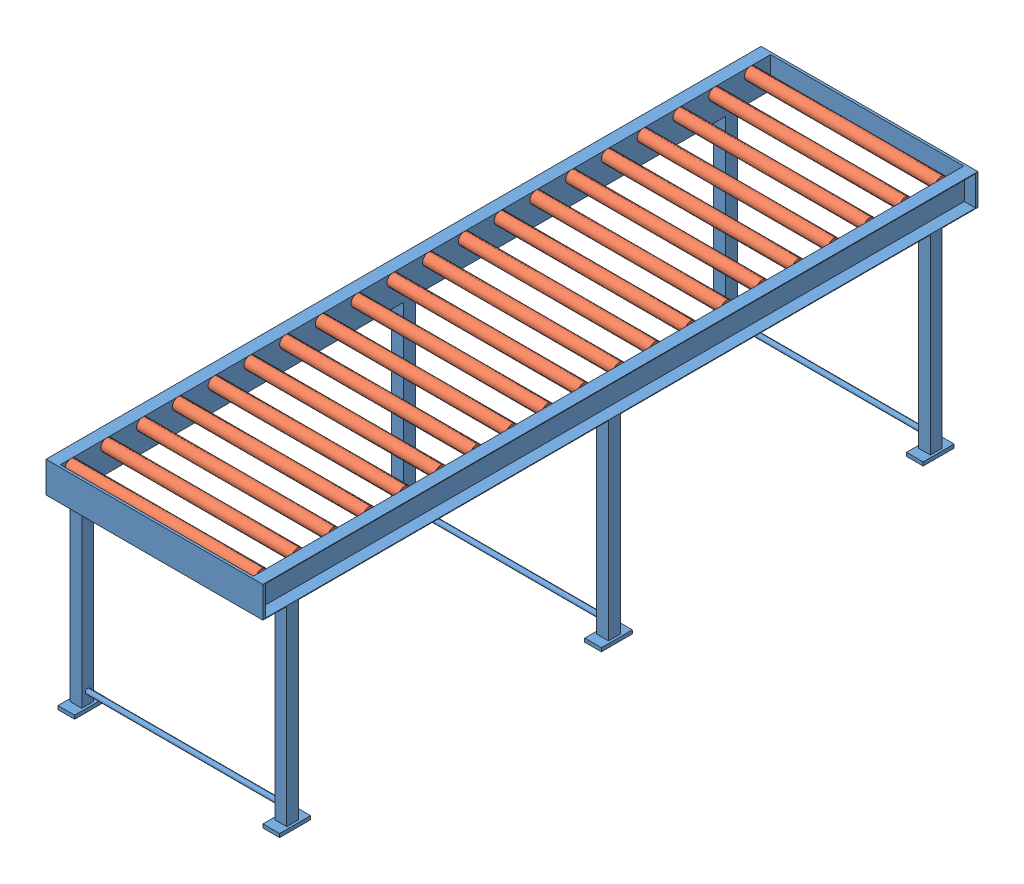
SolidWorks assembly Rollenbahn ZSB.SLDASM, configuration Standard (file format 4700). Lengths in mm.
Overall size (930 960.35 3000).
21 component instances, 2 part files, 40 mates.
Components (placement in the parent):
- Rahmenprofil 65x25-1: Rahmenprofil 65x25.SLDPRT [Standard] at (-273.4733 200.1645 990) size (930 945 3000)
- Transportrolle 50-1: Transportrolle 50.SLDPRT [Standard] at (-693.4733 310.1645 950) x (0 -0.866997 0.498313) z (1 0 0) size (50 50 840)
- Transportrolle 50-2: Transportrolle 50.SLDPRT [Standard] at (-693.4733 310.1645 800) x (0 0.350304 0.936636) z (1 0 0) size (50 50 840)
- Transportrolle 50-3: Transportrolle 50.SLDPRT [Standard] at (-693.4733 310.1645 650) x (0 0.989583 -0.143961) z (1 0 0) size (50 50 840)
- Transportrolle 50-4: Transportrolle 50.SLDPRT [Standard] at (146.5267 310.1645 500) x (0 -0.501387 0.865223) z (-1 0 0) size (50 50 840)
- Transportrolle 50-5: Transportrolle 50.SLDPRT [Standard] at (146.5267 310.1645 350) x (0 -0.723397 0.690432) z (-1 0 0) size (50 50 840)
- Transportrolle 50-6: Transportrolle 50.SLDPRT [Standard] at (146.5267 310.1645 200) x (0 -0.723378 0.690452) z (-1 0 0) size (50 50 840)
- Transportrolle 50-7: Transportrolle 50.SLDPRT [Standard] at (146.5267 310.1645 50) x (0 -0.511224 0.859448) z (-1 0 0) size (50 50 840)
- Transportrolle 50-8: Transportrolle 50.SLDPRT [Standard] at (146.5267 310.1645 -100) x (0 -0.832119 0.554596) z (-1 0 0) size (50 50 840)
- Transportrolle 50-9: Transportrolle 50.SLDPRT [Standard] at (146.5267 310.1645 -250) x (0 -0.997388 0.072231) z (-1 0 0) size (50 50 840)
- Transportrolle 50-10: Transportrolle 50.SLDPRT [Standard] at (146.5267 310.1645 -400) x (0 -0.756698 0.653765) z (-1 0 0) size (50 50 840)
- Transportrolle 50-11: Transportrolle 50.SLDPRT [Standard] at (146.5267 310.1645 -550) x (0 0.143342 0.989673) z (-1 0 0) size (50 50 840)
- Transportrolle 50-12: Transportrolle 50.SLDPRT [Standard] at (146.5267 310.1645 -700) x (0 -0.990083 0.140481) z (-1 0 0) size (50 50 840)
- Transportrolle 50-13: Transportrolle 50.SLDPRT [Standard] at (146.5267 310.1645 -850) x (0 0.999754 -0.022195) z (-1 0 0) size (50 50 840)
- Transportrolle 50-14: Transportrolle 50.SLDPRT [Standard] at (146.5267 310.1645 -1000) x (0 -0.624681 0.78088) z (-1 0 0) size (50 50 840)
- Transportrolle 50-15: Transportrolle 50.SLDPRT [Standard] at (146.5267 310.1645 -1150) x (0 -0.762737 0.646709) z (-1 0 0) size (50 50 840)
- Transportrolle 50-16: Transportrolle 50.SLDPRT [Standard] at (146.5267 310.1645 -1300) x (0 -0.739948 0.672664) z (-1 0 0) size (50 50 840)
- Transportrolle 50-17: Transportrolle 50.SLDPRT [Standard] at (146.5267 310.1645 -1450) x (0 -0.797332 0.603541) z (-1 0 0) size (50 50 840)
- Transportrolle 50-18: Transportrolle 50.SLDPRT [Standard] at (146.5267 310.1645 -1600) x (0 -0.783232 0.621729) z (-1 0 0) size (50 50 840)
- Transportrolle 50-19: Transportrolle 50.SLDPRT [Standard] at (146.5267 310.1645 -1750) x (0 -0.755157 0.655544) z (-1 0 0) size (50 50 840)
- Transportrolle 50-20: Transportrolle 50.SLDPRT [Standard] at (146.5267 310.1645 -1900) x (0 -0.874177 0.485608) z (-1 0 0) size (50 50 840)
Mates (geometry in assembly coordinates):
- Deckungsgleich1: coincident anti-aligned: axis of Rahmenprofil 65x25-1 through (131.5267 310.1645 950) axis (1 0 0); axis of Transportrolle 50-1 through (126.5267 310.1645 950) axis (-1 0 0)
- Deckungsgleich2: coincident anti-aligned: plane of Rahmenprofil 65x25-1 through (131.5267 200.1645 -1990) normal (-1 0 0); plane of Transportrolle 50-1 through (131.5267 310.1645 950) normal (1 0 0)
- Deckungsgleich3: coincident anti-aligned: axis of Rahmenprofil 65x25-1 through (-680.9733 310.1645 800) axis (1 0 0); axis of Transportrolle 50-2 through (126.5267 310.1645 800) axis (-1 0 0)
- Deckungsgleich4: coincident anti-aligned: axis of Rahmenprofil 65x25-1 through (-680.9733 310.1645 650) axis (1 0 0); axis of Transportrolle 50-3 through (126.5267 310.1645 650) axis (-1 0 0)
- Deckungsgleich5: coincident aligned: plane of Transportrolle 50-2 through (131.5267 310.1645 800) normal (1 0 0); plane of Transportrolle 50-3 through (131.5267 310.1645 650) normal (1 0 0)
- Deckungsgleich6: coincident anti-aligned: plane of Rahmenprofil 65x25-1 through (131.5267 200.1645 -1990) normal (-1 0 0); plane of Transportrolle 50-2 through (131.5267 310.1645 800) normal (1 0 0)
- Deckungsgleich25: coincident aligned: plane of Transportrolle 50-3 through (146.5267 310.1645 650) normal (1 0 0); plane of Transportrolle 50-4 through (146.5267 310.1645 500) normal (1 0 0)
- Deckungsgleich26: coincident aligned: plane of Transportrolle 50-3 through (146.5267 310.1645 650) normal (1 0 0); plane of Transportrolle 50-5 through (146.5267 310.1645 350) normal (1 0 0)
- Deckungsgleich27: coincident aligned: plane of Transportrolle 50-3 through (146.5267 310.1645 650) normal (1 0 0); plane of Transportrolle 50-6 through (146.5267 310.1645 200) normal (1 0 0)
- Deckungsgleich28: coincident aligned: plane of Transportrolle 50-3 through (146.5267 310.1645 650) normal (1 0 0); plane of Transportrolle 50-7 through (146.5267 310.1645 50) normal (1 0 0)
- Deckungsgleich29: coincident aligned: plane of Transportrolle 50-3 through (146.5267 310.1645 650) normal (1 0 0); plane of Transportrolle 50-8 through (146.5267 310.1645 -100) normal (1 0 0)
- Deckungsgleich30: coincident aligned: plane of Transportrolle 50-3 through (146.5267 310.1645 650) normal (1 0 0); plane of Transportrolle 50-9 through (146.5267 310.1645 -250) normal (1 0 0)
- Deckungsgleich31: coincident aligned: plane of Transportrolle 50-3 through (146.5267 310.1645 650) normal (1 0 0); plane of Transportrolle 50-10 through (146.5267 310.1645 -400) normal (1 0 0)
- Deckungsgleich32: coincident aligned: plane of Transportrolle 50-3 through (146.5267 310.1645 650) normal (1 0 0); plane of Transportrolle 50-11 through (146.5267 310.1645 -550) normal (1 0 0)
- Deckungsgleich33: coincident aligned: plane of Transportrolle 50-3 through (146.5267 310.1645 650) normal (1 0 0); plane of Transportrolle 50-12 through (146.5267 310.1645 -700) normal (1 0 0)
- Deckungsgleich34: coincident aligned: plane of Transportrolle 50-3 through (146.5267 310.1645 650) normal (1 0 0); plane of Transportrolle 50-13 through (146.5267 310.1645 -850) normal (1 0 0)
- Deckungsgleich35: coincident aligned: plane of Transportrolle 50-3 through (146.5267 310.1645 650) normal (1 0 0); plane of Transportrolle 50-14 through (146.5267 310.1645 -1000) normal (1 0 0)
- Deckungsgleich36: coincident aligned: plane of Transportrolle 50-3 through (146.5267 310.1645 650) normal (1 0 0); plane of Transportrolle 50-15 through (146.5267 310.1645 -1150) normal (1 0 0)
- Deckungsgleich37: coincident aligned: plane of Transportrolle 50-3 through (146.5267 310.1645 650) normal (1 0 0); plane of Transportrolle 50-16 through (146.5267 310.1645 -1300) normal (1 0 0)
- Deckungsgleich38: coincident aligned: plane of Transportrolle 50-3 through (146.5267 310.1645 650) normal (1 0 0); plane of Transportrolle 50-17 through (146.5267 310.1645 -1450) normal (1 0 0)
- Deckungsgleich39: coincident aligned: plane of Transportrolle 50-3 through (146.5267 310.1645 650) normal (1 0 0); plane of Transportrolle 50-18 through (146.5267 310.1645 -1600) normal (1 0 0)
- Deckungsgleich40: coincident aligned: plane of Transportrolle 50-3 through (146.5267 310.1645 650) normal (1 0 0); plane of Transportrolle 50-19 through (146.5267 310.1645 -1750) normal (1 0 0)
- Deckungsgleich41: coincident aligned: plane of Transportrolle 50-3 through (146.5267 310.1645 650) normal (1 0 0); plane of Transportrolle 50-20 through (146.5267 310.1645 -1900) normal (1 0 0)
- Konzentrisch1: concentric aligned: cylinder of Rahmenprofil 65x25-1 through (-738.4733 310.1645 500) axis (1 0 0) radius 6; cylinder of Transportrolle 50-4 through (131.5267 310.1645 500) axis (1 0 0) radius 5.3731
- Konzentrisch2: concentric aligned: cylinder of Rahmenprofil 65x25-1 through (-738.4733 310.1645 350) axis (1 0 0) radius 6; cylinder of Transportrolle 50-5 through (131.5267 310.1645 350) axis (1 0 0) radius 5.3731
- Konzentrisch3: concentric aligned: cylinder of Rahmenprofil 65x25-1 through (-738.4733 310.1645 200) axis (1 0 0) radius 6; cylinder of Transportrolle 50-6 through (131.5267 310.1645 200) axis (1 0 0) radius 5.3731
- Konzentrisch4: concentric aligned: cylinder of Rahmenprofil 65x25-1 through (-738.4733 310.1645 50) axis (1 0 0) radius 6; cylinder of Transportrolle 50-7 through (131.5267 310.1645 50) axis (1 0 0) radius 5.3731
- Konzentrisch5: concentric aligned: cylinder of Rahmenprofil 65x25-1 through (-738.4733 310.1645 -100) axis (1 0 0) radius 6; cylinder of Transportrolle 50-8 through (131.5267 310.1645 -100) axis (1 0 0) radius 5.3731
- Konzentrisch6: concentric aligned: cylinder of Rahmenprofil 65x25-1 through (-738.4733 310.1645 -250) axis (1 0 0) radius 6; cylinder of Transportrolle 50-9 through (131.5267 310.1645 -250) axis (1 0 0) radius 5.3731
- Konzentrisch7: concentric aligned: cylinder of Rahmenprofil 65x25-1 through (-738.4733 310.1645 -400) axis (1 0 0) radius 6; cylinder of Transportrolle 50-10 through (131.5267 310.1645 -400) axis (1 0 0) radius 5.3731
- Konzentrisch8: concentric aligned: cylinder of Rahmenprofil 65x25-1 through (-738.4733 310.1645 -550) axis (1 0 0) radius 6; cylinder of Transportrolle 50-11 through (131.5267 310.1645 -550) axis (1 0 0) radius 5.3731
- Konzentrisch9: concentric aligned: cylinder of Rahmenprofil 65x25-1 through (-738.4733 310.1645 -700) axis (1 0 0) radius 6; cylinder of Transportrolle 50-12 through (131.5267 310.1645 -700) axis (1 0 0) radius 5.3731
- Konzentrisch10: concentric aligned: cylinder of Rahmenprofil 65x25-1 through (-738.4733 310.1645 -850) axis (1 0 0) radius 6; cylinder of Transportrolle 50-13 through (131.5267 310.1645 -850) axis (1 0 0) radius 5.3731
- Konzentrisch11: concentric aligned: cylinder of Rahmenprofil 65x25-1 through (-738.4733 310.1645 -1000) axis (1 0 0) radius 6; cylinder of Transportrolle 50-14 through (131.5267 310.1645 -1000) axis (1 0 0) radius 5.3731
- Konzentrisch12: concentric aligned: cylinder of Rahmenprofil 65x25-1 through (-738.4733 310.1645 -1150) axis (1 0 0) radius 6; cylinder of Transportrolle 50-15 through (131.5267 310.1645 -1150) axis (1 0 0) radius 5.3731
- Konzentrisch13: concentric aligned: cylinder of Rahmenprofil 65x25-1 through (-738.4733 310.1645 -1300) axis (1 0 0) radius 6; cylinder of Transportrolle 50-16 through (131.5267 310.1645 -1300) axis (1 0 0) radius 5.3731
- Konzentrisch14: concentric aligned: cylinder of Rahmenprofil 65x25-1 through (-738.4733 310.1645 -1450) axis (1 0 0) radius 6; cylinder of Transportrolle 50-17 through (131.5267 310.1645 -1450) axis (1 0 0) radius 5.3731
- Konzentrisch15: concentric aligned: cylinder of Rahmenprofil 65x25-1 through (-738.4733 310.1645 -1600) axis (1 0 0) radius 6; cylinder of Transportrolle 50-18 through (131.5267 310.1645 -1600) axis (1 0 0) radius 5.3731
- Konzentrisch16: concentric aligned: cylinder of Rahmenprofil 65x25-1 through (-738.4733 310.1645 -1750) axis (1 0 0) radius 6; cylinder of Transportrolle 50-19 through (131.5267 310.1645 -1750) axis (1 0 0) radius 5.3731
- Konzentrisch17: concentric aligned: cylinder of Rahmenprofil 65x25-1 through (-738.4733 310.1645 -1900) axis (1 0 0) radius 6; cylinder of Transportrolle 50-20 through (131.5267 310.1645 -1900) axis (1 0 0) radius 5.3731
